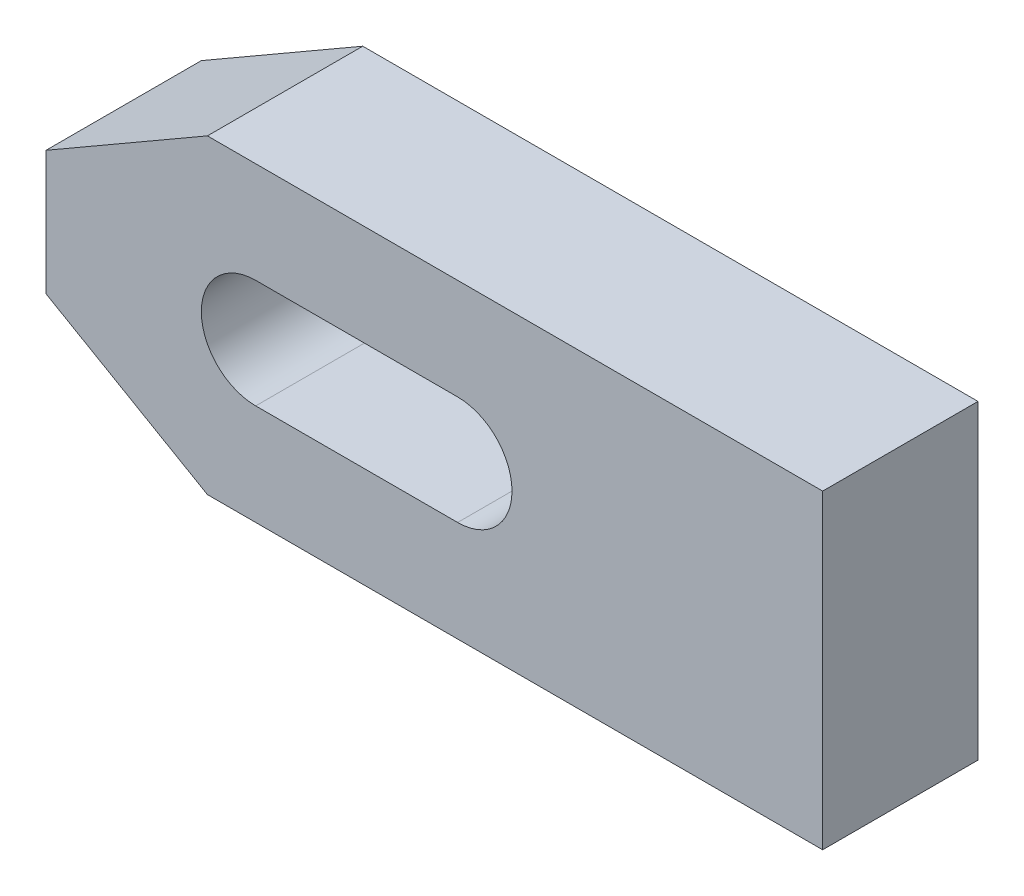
ISO-10303-21;
HEADER;
FILE_DESCRIPTION(('STEP AP214'),'2;1');
FILE_NAME('part.step','',(''),(''),'','','');
FILE_SCHEMA(('AUTOMOTIVE_DESIGN { 1 0 10303 214 1 1 1 1 }'));
ENDSEC;
DATA;
#1=APPLICATION_CONTEXT('core data for automotive mechanical design processes');
#2=APPLICATION_PROTOCOL_DEFINITION('international standard','automotive_design',2000,#1);
#3=PRODUCT_CONTEXT('',#1,'mechanical');
#4=PRODUCT('Part','Part','',(#3));
#5=PRODUCT_RELATED_PRODUCT_CATEGORY('part','',(#4));
#6=PRODUCT_DEFINITION_FORMATION('','',#4);
#7=PRODUCT_DEFINITION_CONTEXT('part definition',#1,'design');
#8=PRODUCT_DEFINITION('design','',#6,#7);
#9=PRODUCT_DEFINITION_SHAPE('','',#8);
#10=(LENGTH_UNIT() NAMED_UNIT(*) SI_UNIT(.MILLI.,.METRE.));
#11=(NAMED_UNIT(*) PLANE_ANGLE_UNIT() SI_UNIT($,.RADIAN.));
#12=(NAMED_UNIT(*) SI_UNIT($,.STERADIAN.) SOLID_ANGLE_UNIT());
#13=UNCERTAINTY_MEASURE_WITH_UNIT(LENGTH_MEASURE(1.E-05),#10,'distance_accuracy_value','');
#14=(GEOMETRIC_REPRESENTATION_CONTEXT(3) GLOBAL_UNCERTAINTY_ASSIGNED_CONTEXT((#13)) GLOBAL_UNIT_ASSIGNED_CONTEXT((#10,
#11,#12)) REPRESENTATION_CONTEXT('',''));
#15=CARTESIAN_POINT('',(0.,0.,0.));
#16=DIRECTION('',(0.,0.,1.));
#17=DIRECTION('',(1.,0.,0.));
#18=AXIS2_PLACEMENT_3D('',#15,#16,#17);
#19=CARTESIAN_POINT('',(23.5,10.,10.));
#20=DIRECTION('',(0.,0.,1.));
#21=DIRECTION('',(1.,0.,0.));
#22=AXIS2_PLACEMENT_3D('',#19,#20,#21);
#23=PLANE('',#22);
#24=DIRECTION('',(0.,1.,0.));
#25=VECTOR('',#24,1.);
#26=CARTESIAN_POINT('',(23.5,-10.,10.));
#27=LINE('',#26,#25);
#28=CARTESIAN_POINT('',(23.5,-10.,10.));
#29=VERTEX_POINT('',#28);
#30=CARTESIAN_POINT('',(23.5,10.,10.));
#31=VERTEX_POINT('',#30);
#32=EDGE_CURVE('E154',#29,#31,#27,.T.);
#33=ORIENTED_EDGE('',*,*,#32,.T.);
#34=DIRECTION('',(-1.,0.,0.));
#35=VECTOR('',#34,1.);
#36=CARTESIAN_POINT('',(23.5,10.,10.));
#37=LINE('',#36,#35);
#38=CARTESIAN_POINT('',(-16.1076951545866,9.99999999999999,10.));
#39=VERTEX_POINT('',#38);
#40=EDGE_CURVE('E157',#31,#39,#37,.T.);
#41=ORIENTED_EDGE('',*,*,#40,.T.);
#42=DIRECTION('',(-0.866025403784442,-0.499999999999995,0.));
#43=VECTOR('',#42,1.);
#44=CARTESIAN_POINT('',(-16.1076951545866,9.99999999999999,10.));
#45=LINE('',#44,#43);
#46=CARTESIAN_POINT('',(-26.5,4.,10.));
#47=VERTEX_POINT('',#46);
#48=EDGE_CURVE('E159',#39,#47,#45,.T.);
#49=ORIENTED_EDGE('',*,*,#48,.T.);
#50=DIRECTION('',(0.,-1.,0.));
#51=VECTOR('',#50,1.);
#52=CARTESIAN_POINT('',(-26.5,4.,10.));
#53=LINE('',#52,#51);
#54=CARTESIAN_POINT('',(-26.5,-4.,10.));
#55=VERTEX_POINT('',#54);
#56=EDGE_CURVE('E161',#47,#55,#53,.T.);
#57=ORIENTED_EDGE('',*,*,#56,.T.);
#58=DIRECTION('',(0.866025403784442,-0.499999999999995,0.));
#59=VECTOR('',#58,1.);
#60=CARTESIAN_POINT('',(-16.1076951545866,-9.99999999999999,10.));
#61=LINE('',#60,#59);
#62=CARTESIAN_POINT('',(-16.1076951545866,-9.99999999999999,10.));
#63=VERTEX_POINT('',#62);
#64=EDGE_CURVE('E163',#55,#63,#61,.T.);
#65=ORIENTED_EDGE('',*,*,#64,.T.);
#66=DIRECTION('',(1.,0.,0.));
#67=VECTOR('',#66,1.);
#68=CARTESIAN_POINT('',(-16.1076951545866,-9.99999999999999,10.));
#69=LINE('',#68,#67);
#70=EDGE_CURVE('E165',#63,#29,#69,.T.);
#71=ORIENTED_EDGE('',*,*,#70,.T.);
#72=EDGE_LOOP('',(#33,#41,#49,#57,#65,#71));
#73=FACE_BOUND('',#72,.T.);
#74=DIRECTION('',(1.,0.,0.));
#75=VECTOR('',#74,1.);
#76=CARTESIAN_POINT('',(-13.,-3.5,10.));
#77=LINE('',#76,#75);
#78=CARTESIAN_POINT('',(-13.,-3.5,10.));
#79=VERTEX_POINT('',#78);
#80=CARTESIAN_POINT('',(0.,-3.5,10.));
#81=VERTEX_POINT('',#80);
#82=EDGE_CURVE('E132',#79,#81,#77,.T.);
#83=ORIENTED_EDGE('',*,*,#82,.F.);
#84=CARTESIAN_POINT('',(-13.,0.,10.));
#85=DIRECTION('',(0.,0.,1.));
#86=DIRECTION('',(-1.,0.,0.));
#87=AXIS2_PLACEMENT_3D('',#84,#85,#86);
#88=CIRCLE('',#87,3.5);
#89=CARTESIAN_POINT('',(-13.,3.5,10.));
#90=VERTEX_POINT('',#89);
#91=EDGE_CURVE('E121',#90,#79,#88,.T.);
#92=ORIENTED_EDGE('',*,*,#91,.F.);
#93=DIRECTION('',(-1.,0.,0.));
#94=VECTOR('',#93,1.);
#95=CARTESIAN_POINT('',(-13.,3.5,10.));
#96=LINE('',#95,#94);
#97=CARTESIAN_POINT('',(0.,3.5,10.));
#98=VERTEX_POINT('',#97);
#99=EDGE_CURVE('E136',#98,#90,#96,.T.);
#100=ORIENTED_EDGE('',*,*,#99,.F.);
#101=CARTESIAN_POINT('',(0.,0.,10.));
#102=DIRECTION('',(0.,0.,1.));
#103=DIRECTION('',(1.,0.,0.));
#104=AXIS2_PLACEMENT_3D('',#101,#102,#103);
#105=CIRCLE('',#104,3.5);
#106=EDGE_CURVE('E134',#81,#98,#105,.T.);
#107=ORIENTED_EDGE('',*,*,#106,.F.);
#108=EDGE_LOOP('',(#83,#92,#100,#107));
#109=FACE_BOUND('',#108,.T.);
#110=ADVANCED_FACE('F29',(#73,#109),#23,.T.);
#111=CARTESIAN_POINT('',(23.5,10.,0.));
#112=DIRECTION('',(0.,0.,1.));
#113=DIRECTION('',(1.,0.,0.));
#114=AXIS2_PLACEMENT_3D('',#111,#112,#113);
#115=PLANE('',#114);
#116=DIRECTION('',(0.,1.,0.));
#117=VECTOR('',#116,1.);
#118=CARTESIAN_POINT('',(23.5,-10.,0.));
#119=LINE('',#118,#117);
#120=CARTESIAN_POINT('',(23.5,-10.,0.));
#121=VERTEX_POINT('',#120);
#122=CARTESIAN_POINT('',(23.5,10.,0.));
#123=VERTEX_POINT('',#122);
#124=EDGE_CURVE('E122',#121,#123,#119,.T.);
#125=ORIENTED_EDGE('',*,*,#124,.F.);
#126=DIRECTION('',(1.,0.,0.));
#127=VECTOR('',#126,1.);
#128=CARTESIAN_POINT('',(-16.1076951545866,-9.99999999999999,0.));
#129=LINE('',#128,#127);
#130=CARTESIAN_POINT('',(-16.1076951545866,-9.99999999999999,0.));
#131=VERTEX_POINT('',#130);
#132=EDGE_CURVE('E152',#131,#121,#129,.T.);
#133=ORIENTED_EDGE('',*,*,#132,.F.);
#134=DIRECTION('',(0.866025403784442,-0.499999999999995,0.));
#135=VECTOR('',#134,1.);
#136=CARTESIAN_POINT('',(-16.1076951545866,-9.99999999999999,0.));
#137=LINE('',#136,#135);
#138=CARTESIAN_POINT('',(-26.5,-4.,0.));
#139=VERTEX_POINT('',#138);
#140=EDGE_CURVE('E150',#139,#131,#137,.T.);
#141=ORIENTED_EDGE('',*,*,#140,.F.);
#142=DIRECTION('',(0.,-1.,0.));
#143=VECTOR('',#142,1.);
#144=CARTESIAN_POINT('',(-26.5,4.,0.));
#145=LINE('',#144,#143);
#146=CARTESIAN_POINT('',(-26.5,4.,0.));
#147=VERTEX_POINT('',#146);
#148=EDGE_CURVE('E148',#147,#139,#145,.T.);
#149=ORIENTED_EDGE('',*,*,#148,.F.);
#150=DIRECTION('',(-0.866025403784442,-0.499999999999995,0.));
#151=VECTOR('',#150,1.);
#152=CARTESIAN_POINT('',(-16.1076951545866,9.99999999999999,0.));
#153=LINE('',#152,#151);
#154=CARTESIAN_POINT('',(-16.1076951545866,9.99999999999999,0.));
#155=VERTEX_POINT('',#154);
#156=EDGE_CURVE('E146',#155,#147,#153,.T.);
#157=ORIENTED_EDGE('',*,*,#156,.F.);
#158=DIRECTION('',(-1.,0.,0.));
#159=VECTOR('',#158,1.);
#160=CARTESIAN_POINT('',(23.5,10.,0.));
#161=LINE('',#160,#159);
#162=EDGE_CURVE('E144',#123,#155,#161,.T.);
#163=ORIENTED_EDGE('',*,*,#162,.F.);
#164=EDGE_LOOP('',(#125,#133,#141,#149,#157,#163));
#165=FACE_BOUND('',#164,.T.);
#166=CARTESIAN_POINT('',(-13.,0.,0.));
#167=DIRECTION('',(0.,0.,1.));
#168=DIRECTION('',(-1.,0.,0.));
#169=AXIS2_PLACEMENT_3D('',#166,#167,#168);
#170=CIRCLE('',#169,3.5);
#171=CARTESIAN_POINT('',(-13.,3.5,0.));
#172=VERTEX_POINT('',#171);
#173=CARTESIAN_POINT('',(-13.,-3.5,0.));
#174=VERTEX_POINT('',#173);
#175=EDGE_CURVE('E52',#172,#174,#170,.T.);
#176=ORIENTED_EDGE('',*,*,#175,.T.);
#177=DIRECTION('',(1.,0.,0.));
#178=VECTOR('',#177,1.);
#179=CARTESIAN_POINT('',(-13.,-3.5,0.));
#180=LINE('',#179,#178);
#181=CARTESIAN_POINT('',(0.,-3.5,0.));
#182=VERTEX_POINT('',#181);
#183=EDGE_CURVE('E108',#174,#182,#180,.T.);
#184=ORIENTED_EDGE('',*,*,#183,.T.);
#185=CARTESIAN_POINT('',(0.,0.,0.));
#186=DIRECTION('',(0.,0.,1.));
#187=DIRECTION('',(1.,0.,0.));
#188=AXIS2_PLACEMENT_3D('',#185,#186,#187);
#189=CIRCLE('',#188,3.5);
#190=CARTESIAN_POINT('',(0.,3.5,0.));
#191=VERTEX_POINT('',#190);
#192=EDGE_CURVE('E117',#182,#191,#189,.T.);
#193=ORIENTED_EDGE('',*,*,#192,.T.);
#194=DIRECTION('',(-1.,0.,0.));
#195=VECTOR('',#194,1.);
#196=CARTESIAN_POINT('',(-13.,3.5,0.));
#197=LINE('',#196,#195);
#198=EDGE_CURVE('E126',#191,#172,#197,.T.);
#199=ORIENTED_EDGE('',*,*,#198,.T.);
#200=EDGE_LOOP('',(#176,#184,#193,#199));
#201=FACE_BOUND('',#200,.T.);
#202=ADVANCED_FACE('F125',(#165,#201),#115,.F.);
#203=CARTESIAN_POINT('',(23.5,-10.,10.));
#204=DIRECTION('',(-1.,0.,0.));
#205=DIRECTION('',(0.,0.,1.));
#206=AXIS2_PLACEMENT_3D('',#203,#204,#205);
#207=PLANE('',#206);
#208=ORIENTED_EDGE('',*,*,#124,.T.);
#209=DIRECTION('',(0.,0.,-1.));
#210=VECTOR('',#209,1.);
#211=CARTESIAN_POINT('',(23.5,10.,10.));
#212=LINE('',#211,#210);
#213=EDGE_CURVE('E11',#31,#123,#212,.T.);
#214=ORIENTED_EDGE('',*,*,#213,.F.);
#215=ORIENTED_EDGE('',*,*,#32,.F.);
#216=DIRECTION('',(0.,0.,-1.));
#217=VECTOR('',#216,1.);
#218=CARTESIAN_POINT('',(23.5,-10.,10.));
#219=LINE('',#218,#217);
#220=EDGE_CURVE('E167',#29,#121,#219,.T.);
#221=ORIENTED_EDGE('',*,*,#220,.T.);
#222=EDGE_LOOP('',(#208,#214,#215,#221));
#223=FACE_BOUND('',#222,.T.);
#224=ADVANCED_FACE('F31',(#223),#207,.F.);
#225=CARTESIAN_POINT('',(23.5,10.,10.));
#226=DIRECTION('',(0.,-1.,0.));
#227=DIRECTION('',(1.,0.,0.));
#228=AXIS2_PLACEMENT_3D('',#225,#226,#227);
#229=PLANE('',#228);
#230=ORIENTED_EDGE('',*,*,#162,.T.);
#231=DIRECTION('',(0.,0.,-1.));
#232=VECTOR('',#231,1.);
#233=CARTESIAN_POINT('',(-16.1076951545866,9.99999999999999,10.));
#234=LINE('',#233,#232);
#235=EDGE_CURVE('E37',#39,#155,#234,.T.);
#236=ORIENTED_EDGE('',*,*,#235,.F.);
#237=ORIENTED_EDGE('',*,*,#40,.F.);
#238=ORIENTED_EDGE('',*,*,#213,.T.);
#239=EDGE_LOOP('',(#230,#236,#237,#238));
#240=FACE_BOUND('',#239,.T.);
#241=ADVANCED_FACE('F205',(#240),#229,.F.);
#242=CARTESIAN_POINT('',(-16.1076951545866,9.99999999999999,10.));
#243=DIRECTION('',(0.499999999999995,-0.866025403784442,0.));
#244=DIRECTION('',(0.866025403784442,0.499999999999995,0.));
#245=AXIS2_PLACEMENT_3D('',#242,#243,#244);
#246=PLANE('',#245);
#247=ORIENTED_EDGE('',*,*,#156,.T.);
#248=DIRECTION('',(0.,0.,-1.));
#249=VECTOR('',#248,1.);
#250=CARTESIAN_POINT('',(-26.5,4.,10.));
#251=LINE('',#250,#249);
#252=EDGE_CURVE('E176',#47,#147,#251,.T.);
#253=ORIENTED_EDGE('',*,*,#252,.F.);
#254=ORIENTED_EDGE('',*,*,#48,.F.);
#255=ORIENTED_EDGE('',*,*,#235,.T.);
#256=EDGE_LOOP('',(#247,#253,#254,#255));
#257=FACE_BOUND('',#256,.T.);
#258=ADVANCED_FACE('F183',(#257),#246,.F.);
#259=CARTESIAN_POINT('',(-26.5,4.,10.));
#260=DIRECTION('',(1.,0.,0.));
#261=DIRECTION('',(0.,0.,-1.));
#262=AXIS2_PLACEMENT_3D('',#259,#260,#261);
#263=PLANE('',#262);
#264=ORIENTED_EDGE('',*,*,#148,.T.);
#265=DIRECTION('',(0.,0.,-1.));
#266=VECTOR('',#265,1.);
#267=CARTESIAN_POINT('',(-26.5,-4.,10.));
#268=LINE('',#267,#266);
#269=EDGE_CURVE('E173',#55,#139,#268,.T.);
#270=ORIENTED_EDGE('',*,*,#269,.F.);
#271=ORIENTED_EDGE('',*,*,#56,.F.);
#272=ORIENTED_EDGE('',*,*,#252,.T.);
#273=EDGE_LOOP('',(#264,#270,#271,#272));
#274=FACE_BOUND('',#273,.T.);
#275=ADVANCED_FACE('F193',(#274),#263,.F.);
#276=CARTESIAN_POINT('',(-16.1076951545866,-9.99999999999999,10.));
#277=DIRECTION('',(0.499999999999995,0.866025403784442,0.));
#278=DIRECTION('',(-0.866025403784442,0.499999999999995,0.));
#279=AXIS2_PLACEMENT_3D('',#276,#277,#278);
#280=PLANE('',#279);
#281=ORIENTED_EDGE('',*,*,#140,.T.);
#282=DIRECTION('',(0.,0.,-1.));
#283=VECTOR('',#282,1.);
#284=CARTESIAN_POINT('',(-16.1076951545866,-9.99999999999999,10.));
#285=LINE('',#284,#283);
#286=EDGE_CURVE('E170',#63,#131,#285,.T.);
#287=ORIENTED_EDGE('',*,*,#286,.F.);
#288=ORIENTED_EDGE('',*,*,#64,.F.);
#289=ORIENTED_EDGE('',*,*,#269,.T.);
#290=EDGE_LOOP('',(#281,#287,#288,#289));
#291=FACE_BOUND('',#290,.T.);
#292=ADVANCED_FACE('F197',(#291),#280,.F.);
#293=CARTESIAN_POINT('',(-16.1076951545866,-9.99999999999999,10.));
#294=DIRECTION('',(0.,1.,0.));
#295=DIRECTION('',(-1.,0.,0.));
#296=AXIS2_PLACEMENT_3D('',#293,#294,#295);
#297=PLANE('',#296);
#298=ORIENTED_EDGE('',*,*,#132,.T.);
#299=ORIENTED_EDGE('',*,*,#220,.F.);
#300=ORIENTED_EDGE('',*,*,#70,.F.);
#301=ORIENTED_EDGE('',*,*,#286,.T.);
#302=EDGE_LOOP('',(#298,#299,#300,#301));
#303=FACE_BOUND('',#302,.T.);
#304=ADVANCED_FACE('F208',(#303),#297,.F.);
#305=CARTESIAN_POINT('',(-13.,0.,10.));
#306=DIRECTION('',(0.,0.,-1.));
#307=DIRECTION('',(-1.,0.,0.));
#308=AXIS2_PLACEMENT_3D('',#305,#306,#307);
#309=CYLINDRICAL_SURFACE('',#308,3.5);
#310=ORIENTED_EDGE('',*,*,#175,.F.);
#311=DIRECTION('',(0.,0.,-1.));
#312=VECTOR('',#311,1.);
#313=CARTESIAN_POINT('',(-13.,3.5,10.));
#314=LINE('',#313,#312);
#315=EDGE_CURVE('E138',#90,#172,#314,.T.);
#316=ORIENTED_EDGE('',*,*,#315,.F.);
#317=ORIENTED_EDGE('',*,*,#91,.T.);
#318=DIRECTION('',(0.,0.,-1.));
#319=VECTOR('',#318,1.);
#320=CARTESIAN_POINT('',(-13.,-3.5,10.));
#321=LINE('',#320,#319);
#322=EDGE_CURVE('E110',#79,#174,#321,.T.);
#323=ORIENTED_EDGE('',*,*,#322,.T.);
#324=EDGE_LOOP('',(#310,#316,#317,#323));
#325=FACE_BOUND('',#324,.T.);
#326=ADVANCED_FACE('F119',(#325),#309,.F.);
#327=CARTESIAN_POINT('',(-13.,-3.5,10.));
#328=DIRECTION('',(0.,1.,0.));
#329=DIRECTION('',(-1.,0.,0.));
#330=AXIS2_PLACEMENT_3D('',#327,#328,#329);
#331=PLANE('',#330);
#332=ORIENTED_EDGE('',*,*,#183,.F.);
#333=ORIENTED_EDGE('',*,*,#322,.F.);
#334=ORIENTED_EDGE('',*,*,#82,.T.);
#335=DIRECTION('',(0.,0.,-1.));
#336=VECTOR('',#335,1.);
#337=CARTESIAN_POINT('',(0.,-3.5,10.));
#338=LINE('',#337,#336);
#339=EDGE_CURVE('E113',#81,#182,#338,.T.);
#340=ORIENTED_EDGE('',*,*,#339,.T.);
#341=EDGE_LOOP('',(#332,#333,#334,#340));
#342=FACE_BOUND('',#341,.T.);
#343=ADVANCED_FACE('F109',(#342),#331,.T.);
#344=CARTESIAN_POINT('',(0.,0.,10.));
#345=DIRECTION('',(0.,0.,-1.));
#346=DIRECTION('',(-1.,0.,0.));
#347=AXIS2_PLACEMENT_3D('',#344,#345,#346);
#348=CYLINDRICAL_SURFACE('',#347,3.5);
#349=ORIENTED_EDGE('',*,*,#192,.F.);
#350=ORIENTED_EDGE('',*,*,#339,.F.);
#351=ORIENTED_EDGE('',*,*,#106,.T.);
#352=DIRECTION('',(0.,0.,-1.));
#353=VECTOR('',#352,1.);
#354=CARTESIAN_POINT('',(0.,3.5,10.));
#355=LINE('',#354,#353);
#356=EDGE_CURVE('E44',#98,#191,#355,.T.);
#357=ORIENTED_EDGE('',*,*,#356,.T.);
#358=EDGE_LOOP('',(#349,#350,#351,#357));
#359=FACE_BOUND('',#358,.T.);
#360=ADVANCED_FACE('F226',(#359),#348,.F.);
#361=CARTESIAN_POINT('',(-13.,3.5,10.));
#362=DIRECTION('',(0.,-1.,0.));
#363=DIRECTION('',(1.,0.,0.));
#364=AXIS2_PLACEMENT_3D('',#361,#362,#363);
#365=PLANE('',#364);
#366=ORIENTED_EDGE('',*,*,#198,.F.);
#367=ORIENTED_EDGE('',*,*,#356,.F.);
#368=ORIENTED_EDGE('',*,*,#99,.T.);
#369=ORIENTED_EDGE('',*,*,#315,.T.);
#370=EDGE_LOOP('',(#366,#367,#368,#369));
#371=FACE_BOUND('',#370,.T.);
#372=ADVANCED_FACE('F229',(#371),#365,.T.);
#373=CLOSED_SHELL('',(#110,#202,#224,#241,#258,#275,#292,#304,#326,#343,#360,#372));
#374=MANIFOLD_SOLID_BREP('B2',#373);
#375=ADVANCED_BREP_SHAPE_REPRESENTATION('',(#18,#374),#14);
#376=SHAPE_DEFINITION_REPRESENTATION(#9,#375);
ENDSEC;
END-ISO-10303-21;
